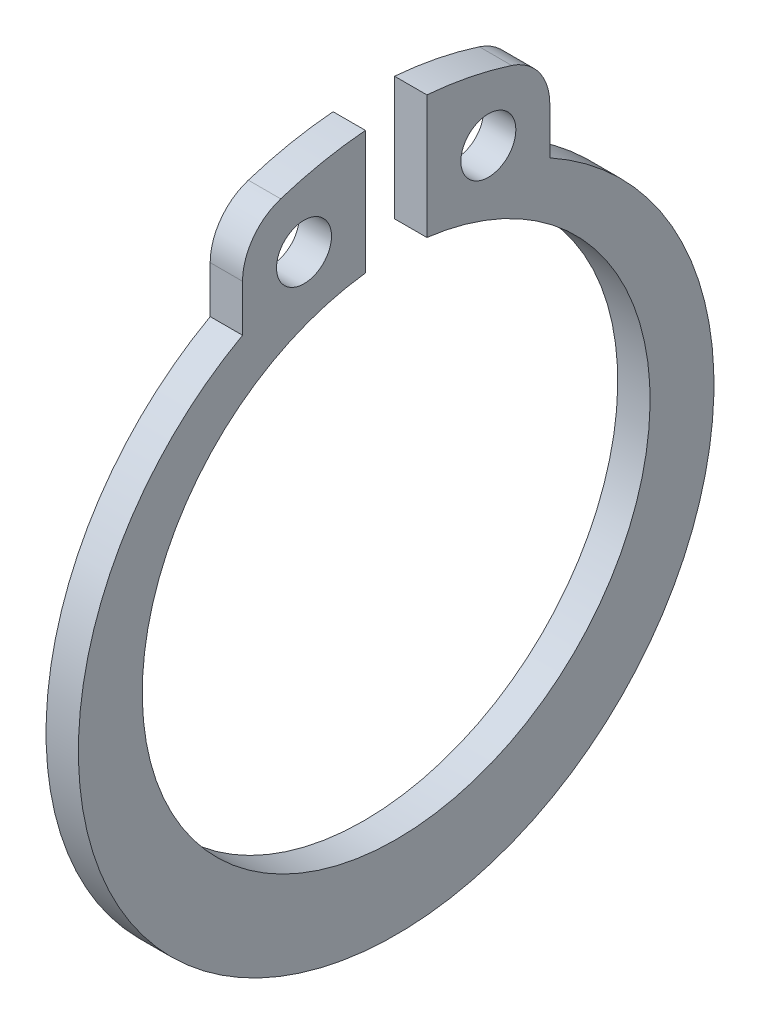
ISO-10303-21;
HEADER;
FILE_DESCRIPTION(('STEP AP214'),'2;1');
FILE_NAME('part.step','',(''),(''),'','','');
FILE_SCHEMA(('AUTOMOTIVE_DESIGN { 1 0 10303 214 1 1 1 1 }'));
ENDSEC;
DATA;
#1=APPLICATION_CONTEXT('core data for automotive mechanical design processes');
#2=APPLICATION_PROTOCOL_DEFINITION('international standard','automotive_design',2000,#1);
#3=PRODUCT_CONTEXT('',#1,'mechanical');
#4=PRODUCT('Part','Part','',(#3));
#5=PRODUCT_RELATED_PRODUCT_CATEGORY('part','',(#4));
#6=PRODUCT_DEFINITION_FORMATION('','',#4);
#7=PRODUCT_DEFINITION_CONTEXT('part definition',#1,'design');
#8=PRODUCT_DEFINITION('design','',#6,#7);
#9=PRODUCT_DEFINITION_SHAPE('','',#8);
#10=(LENGTH_UNIT() NAMED_UNIT(*) SI_UNIT(.MILLI.,.METRE.));
#11=(NAMED_UNIT(*) PLANE_ANGLE_UNIT() SI_UNIT($,.RADIAN.));
#12=(NAMED_UNIT(*) SI_UNIT($,.STERADIAN.) SOLID_ANGLE_UNIT());
#13=UNCERTAINTY_MEASURE_WITH_UNIT(LENGTH_MEASURE(1.E-05),#10,'distance_accuracy_value','');
#14=(GEOMETRIC_REPRESENTATION_CONTEXT(3) GLOBAL_UNCERTAINTY_ASSIGNED_CONTEXT((#13)) GLOBAL_UNIT_ASSIGNED_CONTEXT((#10,
#11,#12)) REPRESENTATION_CONTEXT('',''));
#15=CARTESIAN_POINT('',(0.,0.,0.));
#16=DIRECTION('',(0.,0.,1.));
#17=DIRECTION('',(1.,0.,0.));
#18=AXIS2_PLACEMENT_3D('',#15,#16,#17);
#19=CARTESIAN_POINT('',(1.,-0.575000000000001,0.));
#20=DIRECTION('',(1.,0.,0.));
#21=DIRECTION('',(0.,0.,-1.));
#22=AXIS2_PLACEMENT_3D('',#19,#20,#21);
#23=PLANE('',#22);
#24=CARTESIAN_POINT('',(1.,9.30519320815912,-2.85));
#25=DIRECTION('',(1.,0.,0.));
#26=DIRECTION('',(0.,0.,-1.));
#27=AXIS2_PLACEMENT_3D('',#24,#25,#26);
#28=CIRCLE('',#27,0.85);
#29=CARTESIAN_POINT('',(1.,9.30519320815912,-3.7));
#30=VERTEX_POINT('',#29);
#31=EDGE_CURVE('E150',#30,#30,#28,.T.);
#32=ORIENTED_EDGE('',*,*,#31,.F.);
#33=EDGE_LOOP('',(#32));
#34=FACE_BOUND('',#33,.T.);
#35=CARTESIAN_POINT('',(1.,-0.575000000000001,0.));
#36=DIRECTION('',(1.,0.,0.));
#37=DIRECTION('',(0.,0.,-1.));
#38=AXIS2_PLACEMENT_3D('',#35,#36,#37);
#39=CIRCLE('',#38,9.825);
#40=CARTESIAN_POINT('',(1.,8.02547237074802,4.74999999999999));
#41=VERTEX_POINT('',#40);
#42=CARTESIAN_POINT('',(1.,8.02547237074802,-4.75));
#43=VERTEX_POINT('',#42);
#44=EDGE_CURVE('E165',#41,#43,#39,.T.);
#45=ORIENTED_EDGE('',*,*,#44,.T.);
#46=DIRECTION('',(0.,1.,0.));
#47=VECTOR('',#46,1.);
#48=CARTESIAN_POINT('',(1.,8.02547237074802,-4.75));
#49=LINE('',#48,#47);
#50=CARTESIAN_POINT('',(1.,9.47100839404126,-4.75));
#51=VERTEX_POINT('',#50);
#52=EDGE_CURVE('E103',#43,#51,#49,.T.);
#53=ORIENTED_EDGE('',*,*,#52,.T.);
#54=CARTESIAN_POINT('',(1.,9.47100839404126,-3.04999999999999));
#55=DIRECTION('',(1.,0.,0.));
#56=DIRECTION('',(0.,0.,-1.));
#57=AXIS2_PLACEMENT_3D('',#54,#55,#56);
#58=CIRCLE('',#57,1.7);
#59=CARTESIAN_POINT('',(1.,11.0891706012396,-3.57110562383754));
#60=VERTEX_POINT('',#59);
#61=EDGE_CURVE('E186',#51,#60,#58,.T.);
#62=ORIENTED_EDGE('',*,*,#61,.T.);
#63=CARTESIAN_POINT('',(1.,-1.25247034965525E-12,2.53703308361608E-13));
#64=DIRECTION('',(1.,0.,0.));
#65=DIRECTION('',(0.,0.,-1.));
#66=AXIS2_PLACEMENT_3D('',#63,#64,#65);
#67=CIRCLE('',#66,11.6500000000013);
#68=CARTESIAN_POINT('',(1.,11.6112014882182,-0.949999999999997));
#69=VERTEX_POINT('',#68);
#70=EDGE_CURVE('E205',#60,#69,#67,.T.);
#71=ORIENTED_EDGE('',*,*,#70,.T.);
#72=DIRECTION('',(0.,-1.,0.));
#73=VECTOR('',#72,1.);
#74=CARTESIAN_POINT('',(1.,11.6112014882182,-0.949999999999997));
#75=LINE('',#74,#73);
#76=CARTESIAN_POINT('',(1.,7.79230389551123,-0.949999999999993));
#77=VERTEX_POINT('',#76);
#78=EDGE_CURVE('E202',#69,#77,#75,.T.);
#79=ORIENTED_EDGE('',*,*,#78,.T.);
#80=CARTESIAN_POINT('',(1.,-1.25247034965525E-12,2.53703308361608E-13));
#81=DIRECTION('',(-1.,0.,0.));
#82=DIRECTION('',(0.,0.,1.));
#83=AXIS2_PLACEMENT_3D('',#80,#81,#82);
#84=CIRCLE('',#83,7.85000000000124);
#85=CARTESIAN_POINT('',(1.,7.79230389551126,0.949999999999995));
#86=VERTEX_POINT('',#85);
#87=EDGE_CURVE('E204',#77,#86,#84,.T.);
#88=ORIENTED_EDGE('',*,*,#87,.T.);
#89=DIRECTION('',(0.,1.,0.));
#90=VECTOR('',#89,1.);
#91=CARTESIAN_POINT('',(1.,7.79230389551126,0.949999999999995));
#92=LINE('',#91,#90);
#93=CARTESIAN_POINT('',(1.,11.6112014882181,0.949999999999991));
#94=VERTEX_POINT('',#93);
#95=EDGE_CURVE('E128',#86,#94,#92,.T.);
#96=ORIENTED_EDGE('',*,*,#95,.T.);
#97=CARTESIAN_POINT('',(1.,-1.25247034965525E-12,2.53703308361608E-13));
#98=DIRECTION('',(1.,0.,0.));
#99=DIRECTION('',(0.,0.,-1.));
#100=AXIS2_PLACEMENT_3D('',#97,#98,#99);
#101=CIRCLE('',#100,11.6500000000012);
#102=CARTESIAN_POINT('',(1.,11.0891706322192,3.57110552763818));
#103=VERTEX_POINT('',#102);
#104=EDGE_CURVE('E122',#94,#103,#101,.T.);
#105=ORIENTED_EDGE('',*,*,#104,.T.);
#106=CARTESIAN_POINT('',(1.,9.47100839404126,3.04999999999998));
#107=DIRECTION('',(1.,0.,0.));
#108=DIRECTION('',(0.,0.,-1.));
#109=AXIS2_PLACEMENT_3D('',#106,#107,#108);
#110=CIRCLE('',#109,1.70000000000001);
#111=CARTESIAN_POINT('',(1.,9.47100839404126,4.74999999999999));
#112=VERTEX_POINT('',#111);
#113=EDGE_CURVE('E126',#103,#112,#110,.T.);
#114=ORIENTED_EDGE('',*,*,#113,.T.);
#115=DIRECTION('',(0.,-1.,0.));
#116=VECTOR('',#115,1.);
#117=CARTESIAN_POINT('',(1.,9.47100839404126,4.74999999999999));
#118=LINE('',#117,#116);
#119=EDGE_CURVE('E54',#112,#41,#118,.T.);
#120=ORIENTED_EDGE('',*,*,#119,.T.);
#121=EDGE_LOOP('',(#45,#53,#62,#71,#79,#88,#96,#105,#114,#120));
#122=FACE_BOUND('',#121,.T.);
#123=CARTESIAN_POINT('',(1.,9.30519320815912,2.84999999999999));
#124=DIRECTION('',(1.,0.,0.));
#125=DIRECTION('',(0.,0.,-1.));
#126=AXIS2_PLACEMENT_3D('',#123,#124,#125);
#127=CIRCLE('',#126,0.85);
#128=CARTESIAN_POINT('',(1.,9.30519320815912,1.99999999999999));
#129=VERTEX_POINT('',#128);
#130=EDGE_CURVE('E216',#129,#129,#127,.T.);
#131=ORIENTED_EDGE('',*,*,#130,.F.);
#132=EDGE_LOOP('',(#131));
#133=FACE_BOUND('',#132,.T.);
#134=ADVANCED_FACE('F37',(#34,#122,#133),#23,.T.);
#135=CARTESIAN_POINT('',(0.,-0.575000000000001,0.));
#136=DIRECTION('',(1.,0.,0.));
#137=DIRECTION('',(0.,0.,-1.));
#138=AXIS2_PLACEMENT_3D('',#135,#136,#137);
#139=PLANE('',#138);
#140=CARTESIAN_POINT('',(0.,9.30519320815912,-2.85));
#141=DIRECTION('',(1.,0.,0.));
#142=DIRECTION('',(0.,0.,-1.));
#143=AXIS2_PLACEMENT_3D('',#140,#141,#142);
#144=CIRCLE('',#143,0.85);
#145=CARTESIAN_POINT('',(0.,9.30519320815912,-3.7));
#146=VERTEX_POINT('',#145);
#147=EDGE_CURVE('E213',#146,#146,#144,.T.);
#148=ORIENTED_EDGE('',*,*,#147,.T.);
#149=EDGE_LOOP('',(#148));
#150=FACE_BOUND('',#149,.T.);
#151=CARTESIAN_POINT('',(0.,-0.575000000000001,0.));
#152=DIRECTION('',(1.,0.,0.));
#153=DIRECTION('',(0.,0.,-1.));
#154=AXIS2_PLACEMENT_3D('',#151,#152,#153);
#155=CIRCLE('',#154,9.825);
#156=CARTESIAN_POINT('',(0.,8.02547237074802,4.74999999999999));
#157=VERTEX_POINT('',#156);
#158=CARTESIAN_POINT('',(0.,8.02547237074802,-4.75));
#159=VERTEX_POINT('',#158);
#160=EDGE_CURVE('E146',#157,#159,#155,.T.);
#161=ORIENTED_EDGE('',*,*,#160,.F.);
#162=DIRECTION('',(0.,-1.,0.));
#163=VECTOR('',#162,1.);
#164=CARTESIAN_POINT('',(0.,9.47100839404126,4.74999999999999));
#165=LINE('',#164,#163);
#166=CARTESIAN_POINT('',(0.,9.47100839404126,4.74999999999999));
#167=VERTEX_POINT('',#166);
#168=EDGE_CURVE('E95',#167,#157,#165,.T.);
#169=ORIENTED_EDGE('',*,*,#168,.F.);
#170=CARTESIAN_POINT('',(0.,9.47100839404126,3.04999999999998));
#171=DIRECTION('',(1.,0.,0.));
#172=DIRECTION('',(0.,0.,-1.));
#173=AXIS2_PLACEMENT_3D('',#170,#171,#172);
#174=CIRCLE('',#173,1.70000000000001);
#175=CARTESIAN_POINT('',(0.,11.0891706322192,3.57110552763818));
#176=VERTEX_POINT('',#175);
#177=EDGE_CURVE('E89',#176,#167,#174,.T.);
#178=ORIENTED_EDGE('',*,*,#177,.F.);
#179=CARTESIAN_POINT('',(0.,-1.25247034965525E-12,2.53703308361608E-13));
#180=DIRECTION('',(1.,0.,0.));
#181=DIRECTION('',(0.,0.,-1.));
#182=AXIS2_PLACEMENT_3D('',#179,#180,#181);
#183=CIRCLE('',#182,11.6500000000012);
#184=CARTESIAN_POINT('',(0.,11.6112014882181,0.949999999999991));
#185=VERTEX_POINT('',#184);
#186=EDGE_CURVE('E136',#185,#176,#183,.T.);
#187=ORIENTED_EDGE('',*,*,#186,.F.);
#188=DIRECTION('',(0.,1.,0.));
#189=VECTOR('',#188,1.);
#190=CARTESIAN_POINT('',(0.,7.79230389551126,0.949999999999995));
#191=LINE('',#190,#189);
#192=CARTESIAN_POINT('',(0.,7.79230389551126,0.949999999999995));
#193=VERTEX_POINT('',#192);
#194=EDGE_CURVE('E160',#193,#185,#191,.T.);
#195=ORIENTED_EDGE('',*,*,#194,.F.);
#196=CARTESIAN_POINT('',(0.,-1.25247034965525E-12,2.53703308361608E-13));
#197=DIRECTION('',(-1.,0.,0.));
#198=DIRECTION('',(0.,0.,1.));
#199=AXIS2_PLACEMENT_3D('',#196,#197,#198);
#200=CIRCLE('',#199,7.85000000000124);
#201=CARTESIAN_POINT('',(0.,7.79230389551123,-0.949999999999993));
#202=VERTEX_POINT('',#201);
#203=EDGE_CURVE('E158',#202,#193,#200,.T.);
#204=ORIENTED_EDGE('',*,*,#203,.F.);
#205=DIRECTION('',(0.,-1.,0.));
#206=VECTOR('',#205,1.);
#207=CARTESIAN_POINT('',(0.,11.6112014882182,-0.949999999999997));
#208=LINE('',#207,#206);
#209=CARTESIAN_POINT('',(0.,11.6112014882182,-0.949999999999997));
#210=VERTEX_POINT('',#209);
#211=EDGE_CURVE('E156',#210,#202,#208,.T.);
#212=ORIENTED_EDGE('',*,*,#211,.F.);
#213=CARTESIAN_POINT('',(0.,-1.25247034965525E-12,2.53703308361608E-13));
#214=DIRECTION('',(1.,0.,0.));
#215=DIRECTION('',(0.,0.,-1.));
#216=AXIS2_PLACEMENT_3D('',#213,#214,#215);
#217=CIRCLE('',#216,11.6500000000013);
#218=CARTESIAN_POINT('',(0.,11.0891706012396,-3.57110562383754));
#219=VERTEX_POINT('',#218);
#220=EDGE_CURVE('E154',#219,#210,#217,.T.);
#221=ORIENTED_EDGE('',*,*,#220,.F.);
#222=CARTESIAN_POINT('',(0.,9.47100839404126,-3.04999999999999));
#223=DIRECTION('',(1.,0.,0.));
#224=DIRECTION('',(0.,0.,-1.));
#225=AXIS2_PLACEMENT_3D('',#222,#223,#224);
#226=CIRCLE('',#225,1.7);
#227=CARTESIAN_POINT('',(0.,9.47100839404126,-4.75));
#228=VERTEX_POINT('',#227);
#229=EDGE_CURVE('E152',#228,#219,#226,.T.);
#230=ORIENTED_EDGE('',*,*,#229,.F.);
#231=DIRECTION('',(0.,1.,0.));
#232=VECTOR('',#231,1.);
#233=CARTESIAN_POINT('',(0.,8.02547237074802,-4.75));
#234=LINE('',#233,#232);
#235=EDGE_CURVE('E149',#159,#228,#234,.T.);
#236=ORIENTED_EDGE('',*,*,#235,.F.);
#237=EDGE_LOOP('',(#161,#169,#178,#187,#195,#204,#212,#221,#230,#236));
#238=FACE_BOUND('',#237,.T.);
#239=CARTESIAN_POINT('',(0.,9.30519320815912,2.84999999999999));
#240=DIRECTION('',(1.,0.,0.));
#241=DIRECTION('',(0.,0.,-1.));
#242=AXIS2_PLACEMENT_3D('',#239,#240,#241);
#243=CIRCLE('',#242,0.85);
#244=CARTESIAN_POINT('',(0.,9.30519320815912,1.99999999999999));
#245=VERTEX_POINT('',#244);
#246=EDGE_CURVE('E219',#245,#245,#243,.T.);
#247=ORIENTED_EDGE('',*,*,#246,.T.);
#248=EDGE_LOOP('',(#247));
#249=FACE_BOUND('',#248,.T.);
#250=ADVANCED_FACE('F190',(#150,#238,#249),#139,.F.);
#251=CARTESIAN_POINT('',(1.,-0.575000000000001,0.));
#252=DIRECTION('',(-1.,0.,0.));
#253=DIRECTION('',(0.,0.,1.));
#254=AXIS2_PLACEMENT_3D('',#251,#252,#253);
#255=CYLINDRICAL_SURFACE('',#254,9.825);
#256=ORIENTED_EDGE('',*,*,#160,.T.);
#257=DIRECTION('',(-1.,0.,0.));
#258=VECTOR('',#257,1.);
#259=CARTESIAN_POINT('',(1.,8.02547237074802,-4.75));
#260=LINE('',#259,#258);
#261=EDGE_CURVE('E11',#43,#159,#260,.T.);
#262=ORIENTED_EDGE('',*,*,#261,.F.);
#263=ORIENTED_EDGE('',*,*,#44,.F.);
#264=DIRECTION('',(-1.,0.,0.));
#265=VECTOR('',#264,1.);
#266=CARTESIAN_POINT('',(1.,8.02547237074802,4.74999999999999));
#267=LINE('',#266,#265);
#268=EDGE_CURVE('E142',#41,#157,#267,.T.);
#269=ORIENTED_EDGE('',*,*,#268,.T.);
#270=EDGE_LOOP('',(#256,#262,#263,#269));
#271=FACE_BOUND('',#270,.T.);
#272=ADVANCED_FACE('F39',(#271),#255,.T.);
#273=CARTESIAN_POINT('',(1.,8.02547237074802,-4.75));
#274=DIRECTION('',(0.,0.,1.));
#275=DIRECTION('',(1.,0.,0.));
#276=AXIS2_PLACEMENT_3D('',#273,#274,#275);
#277=PLANE('',#276);
#278=ORIENTED_EDGE('',*,*,#235,.T.);
#279=DIRECTION('',(-1.,0.,0.));
#280=VECTOR('',#279,1.);
#281=CARTESIAN_POINT('',(1.,9.47100839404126,-4.75));
#282=LINE('',#281,#280);
#283=EDGE_CURVE('E46',#51,#228,#282,.T.);
#284=ORIENTED_EDGE('',*,*,#283,.F.);
#285=ORIENTED_EDGE('',*,*,#52,.F.);
#286=ORIENTED_EDGE('',*,*,#261,.T.);
#287=EDGE_LOOP('',(#278,#284,#285,#286));
#288=FACE_BOUND('',#287,.T.);
#289=ADVANCED_FACE('F260',(#288),#277,.F.);
#290=CARTESIAN_POINT('',(1.,9.47100839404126,-3.04999999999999));
#291=DIRECTION('',(-1.,0.,0.));
#292=DIRECTION('',(0.,0.,1.));
#293=AXIS2_PLACEMENT_3D('',#290,#291,#292);
#294=CYLINDRICAL_SURFACE('',#293,1.7);
#295=ORIENTED_EDGE('',*,*,#229,.T.);
#296=DIRECTION('',(-1.,0.,0.));
#297=VECTOR('',#296,1.);
#298=CARTESIAN_POINT('',(1.,11.0891706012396,-3.57110562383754));
#299=LINE('',#298,#297);
#300=EDGE_CURVE('E178',#60,#219,#299,.T.);
#301=ORIENTED_EDGE('',*,*,#300,.F.);
#302=ORIENTED_EDGE('',*,*,#61,.F.);
#303=ORIENTED_EDGE('',*,*,#283,.T.);
#304=EDGE_LOOP('',(#295,#301,#302,#303));
#305=FACE_BOUND('',#304,.T.);
#306=ADVANCED_FACE('F184',(#305),#294,.T.);
#307=CARTESIAN_POINT('',(1.,-1.25247034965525E-12,2.53703308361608E-13));
#308=DIRECTION('',(-1.,0.,0.));
#309=DIRECTION('',(0.,0.,1.));
#310=AXIS2_PLACEMENT_3D('',#307,#308,#309);
#311=CYLINDRICAL_SURFACE('',#310,11.6500000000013);
#312=ORIENTED_EDGE('',*,*,#220,.T.);
#313=DIRECTION('',(-1.,0.,0.));
#314=VECTOR('',#313,1.);
#315=CARTESIAN_POINT('',(1.,11.6112014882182,-0.949999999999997));
#316=LINE('',#315,#314);
#317=EDGE_CURVE('E175',#69,#210,#316,.T.);
#318=ORIENTED_EDGE('',*,*,#317,.F.);
#319=ORIENTED_EDGE('',*,*,#70,.F.);
#320=ORIENTED_EDGE('',*,*,#300,.T.);
#321=EDGE_LOOP('',(#312,#318,#319,#320));
#322=FACE_BOUND('',#321,.T.);
#323=ADVANCED_FACE('F196',(#322),#311,.T.);
#324=CARTESIAN_POINT('',(1.,11.6112014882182,-0.949999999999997));
#325=DIRECTION('',(0.,0.,-1.));
#326=DIRECTION('',(0.,1.,0.));
#327=AXIS2_PLACEMENT_3D('',#324,#325,#326);
#328=PLANE('',#327);
#329=ORIENTED_EDGE('',*,*,#211,.T.);
#330=DIRECTION('',(-1.,0.,0.));
#331=VECTOR('',#330,1.);
#332=CARTESIAN_POINT('',(1.,7.79230389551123,-0.949999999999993));
#333=LINE('',#332,#331);
#334=EDGE_CURVE('E172',#77,#202,#333,.T.);
#335=ORIENTED_EDGE('',*,*,#334,.F.);
#336=ORIENTED_EDGE('',*,*,#78,.F.);
#337=ORIENTED_EDGE('',*,*,#317,.T.);
#338=EDGE_LOOP('',(#329,#335,#336,#337));
#339=FACE_BOUND('',#338,.T.);
#340=ADVANCED_FACE('F200',(#339),#328,.F.);
#341=CARTESIAN_POINT('',(1.,-1.25247034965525E-12,2.53703308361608E-13));
#342=DIRECTION('',(-1.,0.,0.));
#343=DIRECTION('',(0.,0.,1.));
#344=AXIS2_PLACEMENT_3D('',#341,#342,#343);
#345=CYLINDRICAL_SURFACE('',#344,7.85000000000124);
#346=ORIENTED_EDGE('',*,*,#203,.T.);
#347=DIRECTION('',(-1.,0.,0.));
#348=VECTOR('',#347,1.);
#349=CARTESIAN_POINT('',(1.,7.79230389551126,0.949999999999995));
#350=LINE('',#349,#348);
#351=EDGE_CURVE('E169',#86,#193,#350,.T.);
#352=ORIENTED_EDGE('',*,*,#351,.F.);
#353=ORIENTED_EDGE('',*,*,#87,.F.);
#354=ORIENTED_EDGE('',*,*,#334,.T.);
#355=EDGE_LOOP('',(#346,#352,#353,#354));
#356=FACE_BOUND('',#355,.T.);
#357=ADVANCED_FACE('F250',(#356),#345,.F.);
#358=CARTESIAN_POINT('',(1.,7.79230389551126,0.949999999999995));
#359=DIRECTION('',(0.,0.,1.));
#360=DIRECTION('',(0.,-1.,0.));
#361=AXIS2_PLACEMENT_3D('',#358,#359,#360);
#362=PLANE('',#361);
#363=ORIENTED_EDGE('',*,*,#194,.T.);
#364=DIRECTION('',(-1.,0.,0.));
#365=VECTOR('',#364,1.);
#366=CARTESIAN_POINT('',(1.,11.6112014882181,0.949999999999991));
#367=LINE('',#366,#365);
#368=EDGE_CURVE('E137',#94,#185,#367,.T.);
#369=ORIENTED_EDGE('',*,*,#368,.F.);
#370=ORIENTED_EDGE('',*,*,#95,.F.);
#371=ORIENTED_EDGE('',*,*,#351,.T.);
#372=EDGE_LOOP('',(#363,#369,#370,#371));
#373=FACE_BOUND('',#372,.T.);
#374=ADVANCED_FACE('F247',(#373),#362,.F.);
#375=CARTESIAN_POINT('',(1.,-1.25247034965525E-12,2.53703308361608E-13));
#376=DIRECTION('',(-1.,0.,0.));
#377=DIRECTION('',(0.,0.,1.));
#378=AXIS2_PLACEMENT_3D('',#375,#376,#377);
#379=CYLINDRICAL_SURFACE('',#378,11.6500000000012);
#380=ORIENTED_EDGE('',*,*,#186,.T.);
#381=DIRECTION('',(-1.,0.,0.));
#382=VECTOR('',#381,1.);
#383=CARTESIAN_POINT('',(1.,11.0891706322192,3.57110552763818));
#384=LINE('',#383,#382);
#385=EDGE_CURVE('E133',#103,#176,#384,.T.);
#386=ORIENTED_EDGE('',*,*,#385,.F.);
#387=ORIENTED_EDGE('',*,*,#104,.F.);
#388=ORIENTED_EDGE('',*,*,#368,.T.);
#389=EDGE_LOOP('',(#380,#386,#387,#388));
#390=FACE_BOUND('',#389,.T.);
#391=ADVANCED_FACE('F134',(#390),#379,.T.);
#392=CARTESIAN_POINT('',(1.,9.47100839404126,3.04999999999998));
#393=DIRECTION('',(-1.,0.,0.));
#394=DIRECTION('',(0.,0.,1.));
#395=AXIS2_PLACEMENT_3D('',#392,#393,#394);
#396=CYLINDRICAL_SURFACE('',#395,1.70000000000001);
#397=ORIENTED_EDGE('',*,*,#177,.T.);
#398=DIRECTION('',(-1.,0.,0.));
#399=VECTOR('',#398,1.);
#400=CARTESIAN_POINT('',(1.,9.47100839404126,4.74999999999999));
#401=LINE('',#400,#399);
#402=EDGE_CURVE('E138',#112,#167,#401,.T.);
#403=ORIENTED_EDGE('',*,*,#402,.F.);
#404=ORIENTED_EDGE('',*,*,#113,.F.);
#405=ORIENTED_EDGE('',*,*,#385,.T.);
#406=EDGE_LOOP('',(#397,#403,#404,#405));
#407=FACE_BOUND('',#406,.T.);
#408=ADVANCED_FACE('F140',(#407),#396,.T.);
#409=CARTESIAN_POINT('',(1.,9.47100839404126,4.74999999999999));
#410=DIRECTION('',(0.,0.,-1.));
#411=DIRECTION('',(-1.,0.,0.));
#412=AXIS2_PLACEMENT_3D('',#409,#410,#411);
#413=PLANE('',#412);
#414=ORIENTED_EDGE('',*,*,#168,.T.);
#415=ORIENTED_EDGE('',*,*,#268,.F.);
#416=ORIENTED_EDGE('',*,*,#119,.F.);
#417=ORIENTED_EDGE('',*,*,#402,.T.);
#418=EDGE_LOOP('',(#414,#415,#416,#417));
#419=FACE_BOUND('',#418,.T.);
#420=ADVANCED_FACE('F240',(#419),#413,.F.);
#421=CARTESIAN_POINT('',(1.,9.30519320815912,-2.85));
#422=DIRECTION('',(-1.,0.,0.));
#423=DIRECTION('',(0.,0.,1.));
#424=AXIS2_PLACEMENT_3D('',#421,#422,#423);
#425=CYLINDRICAL_SURFACE('',#424,0.85);
#426=ORIENTED_EDGE('',*,*,#31,.T.);
#427=EDGE_LOOP('',(#426));
#428=FACE_BOUND('',#427,.T.);
#429=ORIENTED_EDGE('',*,*,#147,.F.);
#430=EDGE_LOOP('',(#429));
#431=FACE_BOUND('',#430,.T.);
#432=ADVANCED_FACE('F237',(#428,#431),#425,.F.);
#433=CARTESIAN_POINT('',(1.,9.30519320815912,2.84999999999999));
#434=DIRECTION('',(-1.,0.,0.));
#435=DIRECTION('',(0.,0.,1.));
#436=AXIS2_PLACEMENT_3D('',#433,#434,#435);
#437=CYLINDRICAL_SURFACE('',#436,0.85);
#438=ORIENTED_EDGE('',*,*,#130,.T.);
#439=EDGE_LOOP('',(#438));
#440=FACE_BOUND('',#439,.T.);
#441=ORIENTED_EDGE('',*,*,#246,.F.);
#442=EDGE_LOOP('',(#441));
#443=FACE_BOUND('',#442,.T.);
#444=ADVANCED_FACE('F225',(#440,#443),#437,.F.);
#445=CLOSED_SHELL('',(#134,#250,#272,#289,#306,#323,#340,#357,#374,#391,#408,#420,#432,#444));
#446=MANIFOLD_SOLID_BREP('B2',#445);
#447=ADVANCED_BREP_SHAPE_REPRESENTATION('',(#18,#446),#14);
#448=SHAPE_DEFINITION_REPRESENTATION(#9,#447);
ENDSEC;
END-ISO-10303-21;
